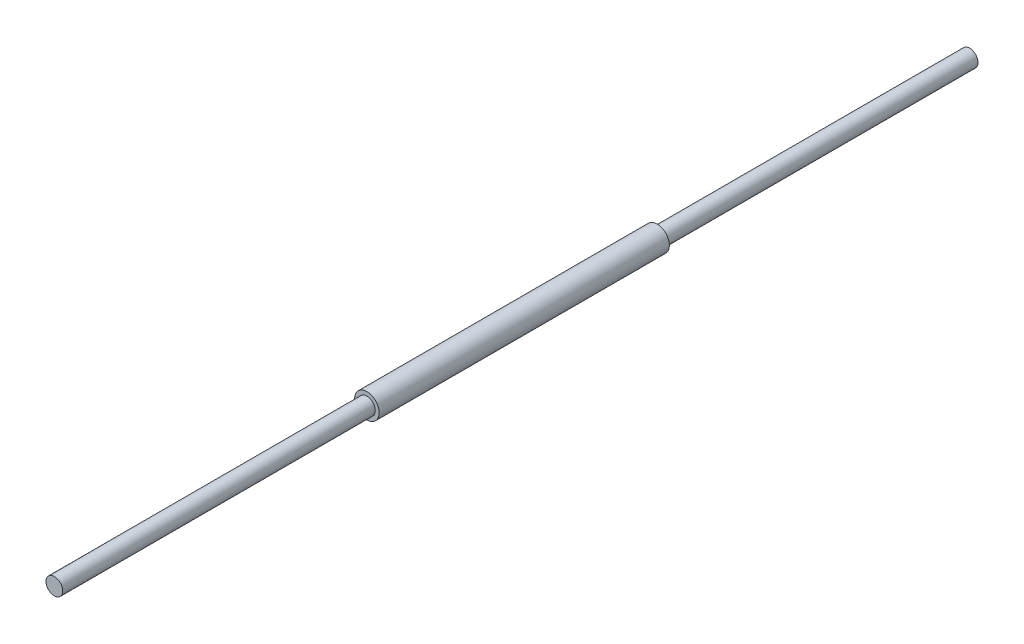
from build123d import *

# Parameters (mm, degrees)
SKETCH1_R           = 4.7625
BOSS_EXTRUDE1_DEPTH = 520.7
SKETCH2_R           = 6.985
BOSS_EXTRUDE2_DEPTH = 82.55


with BuildPart() as part:
    # Sketch1 → Boss-Extrude1 (new body)
    with BuildSketch(Plane.XY):
        Circle(SKETCH1_R)
    extrude(amount=-BOSS_EXTRUDE1_DEPTH)

    # Sketch2 → Boss-Extrude2 (add, symmetric)
    with BuildSketch(Plane.XY.offset(-260.35)):
        Circle(SKETCH2_R)
    extrude(amount=BOSS_EXTRUDE2_DEPTH, both=True)


solid = part.part
